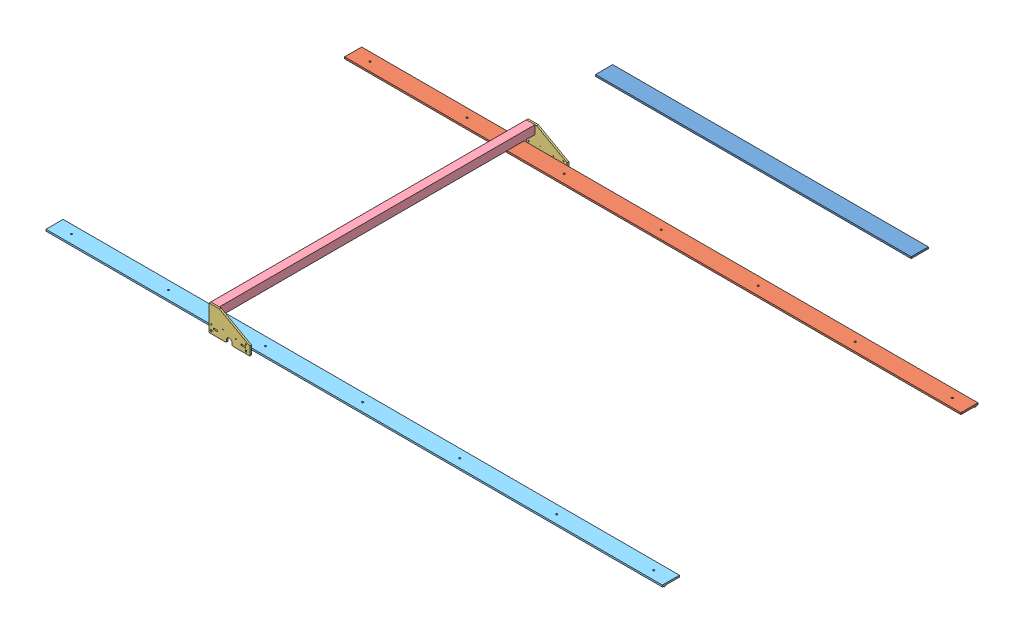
SolidWorks assembly Assem8.sldasm, configuration Default (file format 4400). Lengths in mm.
Overall size (3657.6 630.8 3043.23).
6 component instances, 5 part files, 7 mates.
Components (placement in the parent):
- gantry flatbar-1: gantry flatbar.SLDPRT [Default] at (-245.5382 29.8392 105.8979) size (1873.25 10 101.6)
- x axis-1: x axis.SLDPRT [Default] at (2145.8199 550.6945 1289.9197) x (0 0 -1) z (-1 0 0) size (101.6 15 3657.6)
- y axis end brackets-1: y axis end brackets.SLDPRT [Default] at (-331.5015 532.8252 1205.0809) size (241.3 152.4 10)
- y axis track-1: y axis track.SLDPRT [Default] at (-533.8801 609.8433 1215.0809) x (-1 0 0) z (0 1 0) size (55.8 1873.25 50.8)
- y axis end brackets-2: y axis end brackets.SLDPRT [Default] at (-331.5015 532.8252 3088.3309) size (241.3 152.4 10)
- Mirrorx axis-2: Mirrorx axis.SLDPRT [Default] at (2145.8199 550.6945 3013.4922) x (0 0 1) z (1 0 0) size (101.6 15 3657.6)
Mates (geometry in assembly coordinates):
- Coincident2: coincident aligned: plane of y axis end brackets-1 through (-533.8801 660.6433 1205.0809) normal (-1 0 0); plane of y axis track-1 through (-533.8801 609.8433 3088.3309) normal (-1 0 0)
- Coincident3: coincident aligned: plane of y axis end brackets-1 through (-473.4281 660.6433 1205.0809) normal (0 1 0); plane of y axis track-1 through (-533.8801 660.6433 1215.0809) normal (0 1 0)
- Coincident5: coincident anti-aligned: plane of y axis end brackets-1 through (-392.171 514.5933 1215.0809) normal (0 0 1); plane of y axis track-1 through (-533.8801 660.6433 1215.0809) normal (0 0 -1)
- Coincident6: coincident anti-aligned: plane of x axis-1 through (-1511.7801 535.5508 1215.0809) normal (0 0 -1); plane of y axis end brackets-1 through (-392.171 514.5933 1215.0809) normal (0 0 1)
- Coincident7: coincident anti-aligned: line of x axis-1 through (-1511.7801 545.5508 1215.0809) axis (1 0 0); line of y axis end brackets-1 through (-317.9801 545.5508 1215.0809) axis (-1 0 0)
- Distance2: distance = 1219.2 mm anti-aligned: plane of x axis-1 through (-1511.7801 545.5508 1316.6809) normal (-1 0 0); plane of y axis end brackets-1 through (-292.5801 508.2433 1205.0809) normal (1 0 0)
- PLANE1: unknown: moEndPointRef_w of y axis track-1; unknown of y axis track-1; unknown of y axis track-1
